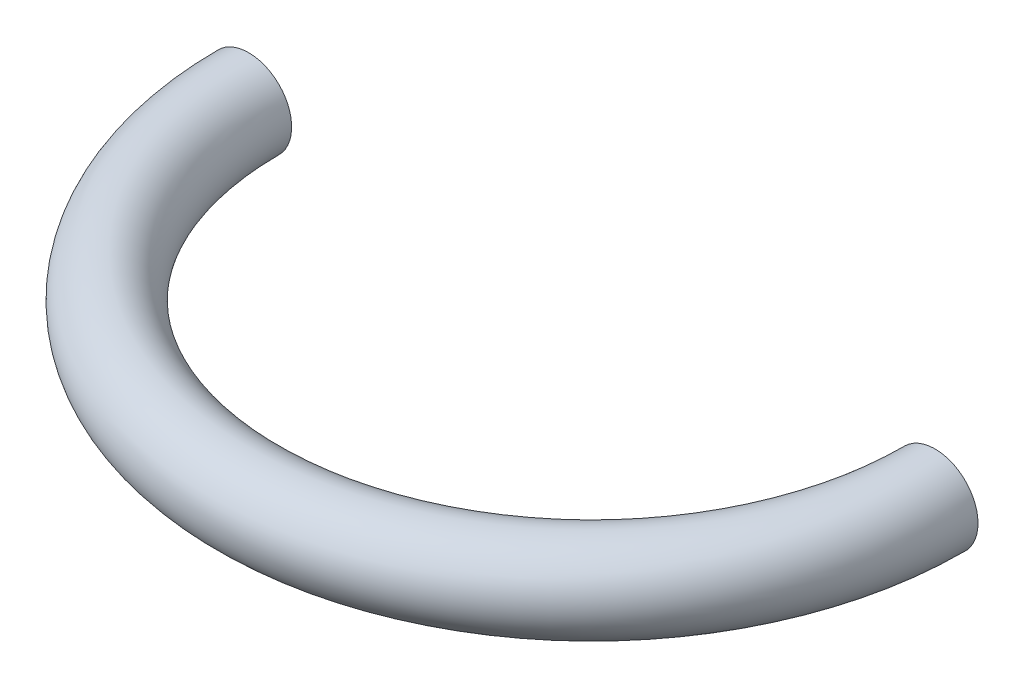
from build123d import *

# Parameters (mm, degrees)
SKIZZE1_R       = 2.5
ROTATION1_ANGLE = 180


with BuildPart() as part:
    # Skizze1 → Rotation1 (revolve)
    with BuildSketch(Plane.XY):
        with Locations((-20, 0)):
            Circle(SKIZZE1_R)
    revolve(axis=Axis((0, 0, 0), (0, 1, 0)), revolution_arc=ROTATION1_ANGLE)


solid = part.part
